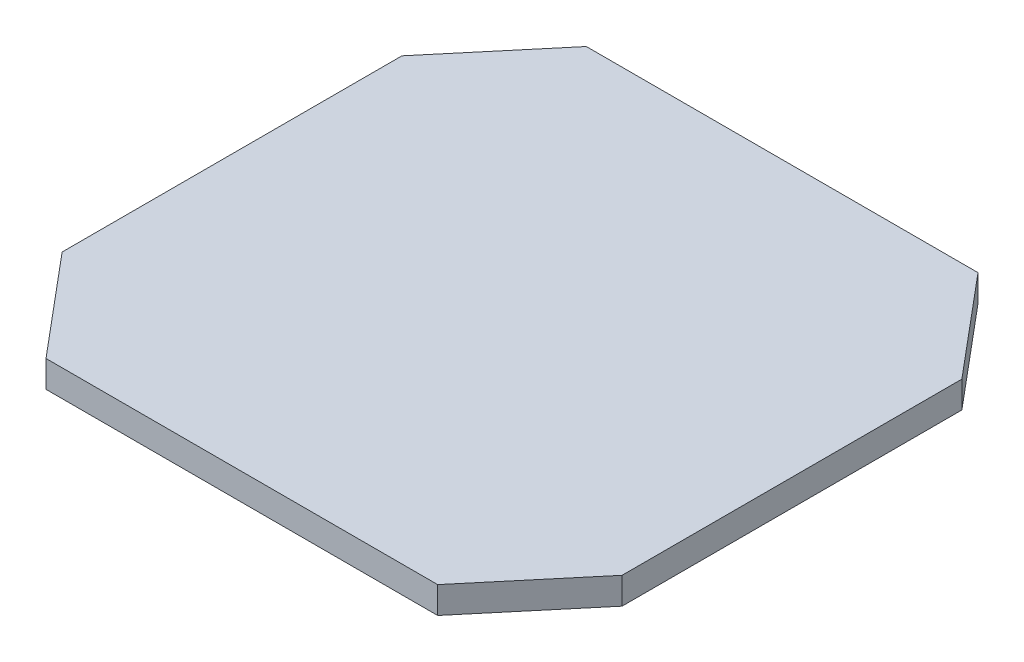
ISO-10303-21;
HEADER;
FILE_DESCRIPTION(('STEP AP214'),'2;1');
FILE_NAME('part.step','',(''),(''),'','','');
FILE_SCHEMA(('AUTOMOTIVE_DESIGN { 1 0 10303 214 1 1 1 1 }'));
ENDSEC;
DATA;
#1=APPLICATION_CONTEXT('core data for automotive mechanical design processes');
#2=APPLICATION_PROTOCOL_DEFINITION('international standard','automotive_design',2000,#1);
#3=PRODUCT_CONTEXT('',#1,'mechanical');
#4=PRODUCT('Part','Part','',(#3));
#5=PRODUCT_RELATED_PRODUCT_CATEGORY('part','',(#4));
#6=PRODUCT_DEFINITION_FORMATION('','',#4);
#7=PRODUCT_DEFINITION_CONTEXT('part definition',#1,'design');
#8=PRODUCT_DEFINITION('design','',#6,#7);
#9=PRODUCT_DEFINITION_SHAPE('','',#8);
#10=(LENGTH_UNIT() NAMED_UNIT(*) SI_UNIT(.MILLI.,.METRE.));
#11=(NAMED_UNIT(*) PLANE_ANGLE_UNIT() SI_UNIT($,.RADIAN.));
#12=(NAMED_UNIT(*) SI_UNIT($,.STERADIAN.) SOLID_ANGLE_UNIT());
#13=UNCERTAINTY_MEASURE_WITH_UNIT(LENGTH_MEASURE(1.E-05),#10,'distance_accuracy_value','');
#14=(GEOMETRIC_REPRESENTATION_CONTEXT(3) GLOBAL_UNCERTAINTY_ASSIGNED_CONTEXT((#13)) GLOBAL_UNIT_ASSIGNED_CONTEXT((#10,
#11,#12)) REPRESENTATION_CONTEXT('',''));
#15=CARTESIAN_POINT('',(0.,0.,0.));
#16=DIRECTION('',(0.,0.,1.));
#17=DIRECTION('',(1.,0.,0.));
#18=AXIS2_PLACEMENT_3D('',#15,#16,#17);
#19=CARTESIAN_POINT('',(-15.7,-1.5,9.52683869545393));
#20=DIRECTION('',(0.766044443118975,0.,-0.642787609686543));
#21=DIRECTION('',(-0.642787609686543,0.,-0.766044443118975));
#22=AXIS2_PLACEMENT_3D('',#19,#20,#21);
#23=PLANE('',#22);
#24=DIRECTION('',(-0.642787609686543,0.,-0.766044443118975));
#25=VECTOR('',#24,1.);
#26=CARTESIAN_POINT('',(-15.7,0.,9.52683869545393));
#27=LINE('',#26,#25);
#28=CARTESIAN_POINT('',(-10.9816252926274,0.,15.1499787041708));
#29=VERTEX_POINT('',#28);
#30=CARTESIAN_POINT('',(-15.7,0.,9.52683869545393));
#31=VERTEX_POINT('',#30);
#32=EDGE_CURVE('E139',#29,#31,#27,.T.);
#33=ORIENTED_EDGE('',*,*,#32,.T.);
#34=DIRECTION('',(0.,1.,0.));
#35=VECTOR('',#34,1.);
#36=CARTESIAN_POINT('',(-15.7,-1.5,9.52683869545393));
#37=LINE('',#36,#35);
#38=CARTESIAN_POINT('',(-15.7,-1.5,9.52683869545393));
#39=VERTEX_POINT('',#38);
#40=EDGE_CURVE('E12',#39,#31,#37,.T.);
#41=ORIENTED_EDGE('',*,*,#40,.F.);
#42=DIRECTION('',(-0.642787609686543,0.,-0.766044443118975));
#43=VECTOR('',#42,1.);
#44=CARTESIAN_POINT('',(-15.7,-1.5,9.52683869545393));
#45=LINE('',#44,#43);
#46=CARTESIAN_POINT('',(-10.9816252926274,-1.5,15.1499787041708));
#47=VERTEX_POINT('',#46);
#48=EDGE_CURVE('E153',#47,#39,#45,.T.);
#49=ORIENTED_EDGE('',*,*,#48,.F.);
#50=DIRECTION('',(0.,1.,0.));
#51=VECTOR('',#50,1.);
#52=CARTESIAN_POINT('',(-10.9816252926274,-1.5,15.1499787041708));
#53=LINE('',#52,#51);
#54=EDGE_CURVE('E135',#47,#29,#53,.T.);
#55=ORIENTED_EDGE('',*,*,#54,.T.);
#56=EDGE_LOOP('',(#33,#41,#49,#55));
#57=FACE_BOUND('',#56,.T.);
#58=ADVANCED_FACE('F43',(#57),#23,.F.);
#59=CARTESIAN_POINT('',(-15.7,-1.5,-9.52683869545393));
#60=DIRECTION('',(1.,0.,0.));
#61=DIRECTION('',(0.,0.,-1.));
#62=AXIS2_PLACEMENT_3D('',#59,#60,#61);
#63=PLANE('',#62);
#64=DIRECTION('',(0.,0.,-1.));
#65=VECTOR('',#64,1.);
#66=CARTESIAN_POINT('',(-15.7,0.,-9.52683869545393));
#67=LINE('',#66,#65);
#68=CARTESIAN_POINT('',(-15.7,0.,-9.52683869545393));
#69=VERTEX_POINT('',#68);
#70=EDGE_CURVE('E142',#31,#69,#67,.T.);
#71=ORIENTED_EDGE('',*,*,#70,.T.);
#72=DIRECTION('',(0.,1.,0.));
#73=VECTOR('',#72,1.);
#74=CARTESIAN_POINT('',(-15.7,-1.5,-9.52683869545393));
#75=LINE('',#74,#73);
#76=CARTESIAN_POINT('',(-15.7,-1.5,-9.52683869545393));
#77=VERTEX_POINT('',#76);
#78=EDGE_CURVE('E51',#77,#69,#75,.T.);
#79=ORIENTED_EDGE('',*,*,#78,.F.);
#80=DIRECTION('',(0.,0.,-1.));
#81=VECTOR('',#80,1.);
#82=CARTESIAN_POINT('',(-15.7,-1.5,-9.52683869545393));
#83=LINE('',#82,#81);
#84=EDGE_CURVE('E102',#39,#77,#83,.T.);
#85=ORIENTED_EDGE('',*,*,#84,.F.);
#86=ORIENTED_EDGE('',*,*,#40,.T.);
#87=EDGE_LOOP('',(#71,#79,#85,#86));
#88=FACE_BOUND('',#87,.T.);
#89=ADVANCED_FACE('F188',(#88),#63,.F.);
#90=CARTESIAN_POINT('',(-15.7,-1.5,-9.52683869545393));
#91=DIRECTION('',(0.766044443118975,0.,0.642787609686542));
#92=DIRECTION('',(0.642787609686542,0.,-0.766044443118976));
#93=AXIS2_PLACEMENT_3D('',#90,#91,#92);
#94=PLANE('',#93);
#95=DIRECTION('',(0.642787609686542,0.,-0.766044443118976));
#96=VECTOR('',#95,1.);
#97=CARTESIAN_POINT('',(-15.7,0.,-9.52683869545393));
#98=LINE('',#97,#96);
#99=CARTESIAN_POINT('',(-10.9816252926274,0.,-15.1499787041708));
#100=VERTEX_POINT('',#99);
#101=EDGE_CURVE('E144',#69,#100,#98,.T.);
#102=ORIENTED_EDGE('',*,*,#101,.T.);
#103=DIRECTION('',(0.,1.,0.));
#104=VECTOR('',#103,1.);
#105=CARTESIAN_POINT('',(-10.9816252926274,-1.5,-15.1499787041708));
#106=LINE('',#105,#104);
#107=CARTESIAN_POINT('',(-10.9816252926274,-1.5,-15.1499787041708));
#108=VERTEX_POINT('',#107);
#109=EDGE_CURVE('E160',#108,#100,#106,.T.);
#110=ORIENTED_EDGE('',*,*,#109,.F.);
#111=DIRECTION('',(0.642787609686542,0.,-0.766044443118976));
#112=VECTOR('',#111,1.);
#113=CARTESIAN_POINT('',(-15.7,-1.5,-9.52683869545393));
#114=LINE('',#113,#112);
#115=EDGE_CURVE('E168',#77,#108,#114,.T.);
#116=ORIENTED_EDGE('',*,*,#115,.F.);
#117=ORIENTED_EDGE('',*,*,#78,.T.);
#118=EDGE_LOOP('',(#102,#110,#116,#117));
#119=FACE_BOUND('',#118,.T.);
#120=ADVANCED_FACE('F166',(#119),#94,.F.);
#121=CARTESIAN_POINT('',(10.9816252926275,-1.5,-15.1499787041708));
#122=DIRECTION('',(0.,0.,1.));
#123=DIRECTION('',(1.,0.,0.));
#124=AXIS2_PLACEMENT_3D('',#121,#122,#123);
#125=PLANE('',#124);
#126=DIRECTION('',(1.,0.,0.));
#127=VECTOR('',#126,1.);
#128=CARTESIAN_POINT('',(10.9816252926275,0.,-15.1499787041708));
#129=LINE('',#128,#127);
#130=CARTESIAN_POINT('',(10.9816252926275,0.,-15.1499787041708));
#131=VERTEX_POINT('',#130);
#132=EDGE_CURVE('E146',#100,#131,#129,.T.);
#133=ORIENTED_EDGE('',*,*,#132,.T.);
#134=DIRECTION('',(0.,1.,0.));
#135=VECTOR('',#134,1.);
#136=CARTESIAN_POINT('',(10.9816252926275,-1.5,-15.1499787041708));
#137=LINE('',#136,#135);
#138=CARTESIAN_POINT('',(10.9816252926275,-1.5,-15.1499787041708));
#139=VERTEX_POINT('',#138);
#140=EDGE_CURVE('E157',#139,#131,#137,.T.);
#141=ORIENTED_EDGE('',*,*,#140,.F.);
#142=DIRECTION('',(1.,0.,0.));
#143=VECTOR('',#142,1.);
#144=CARTESIAN_POINT('',(10.9816252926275,-1.5,-15.1499787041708));
#145=LINE('',#144,#143);
#146=EDGE_CURVE('E180',#108,#139,#145,.T.);
#147=ORIENTED_EDGE('',*,*,#146,.F.);
#148=ORIENTED_EDGE('',*,*,#109,.T.);
#149=EDGE_LOOP('',(#133,#141,#147,#148));
#150=FACE_BOUND('',#149,.T.);
#151=ADVANCED_FACE('F176',(#150),#125,.F.);
#152=CARTESIAN_POINT('',(10.9816252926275,-1.5,-15.1499787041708));
#153=DIRECTION('',(-0.76604444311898,0.,0.642787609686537));
#154=DIRECTION('',(0.642787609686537,0.,0.76604444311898));
#155=AXIS2_PLACEMENT_3D('',#152,#153,#154);
#156=PLANE('',#155);
#157=DIRECTION('',(0.642787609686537,0.,0.76604444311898));
#158=VECTOR('',#157,1.);
#159=CARTESIAN_POINT('',(10.9816252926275,0.,-15.1499787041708));
#160=LINE('',#159,#158);
#161=CARTESIAN_POINT('',(15.7,0.,-9.52683869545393));
#162=VERTEX_POINT('',#161);
#163=EDGE_CURVE('E148',#131,#162,#160,.T.);
#164=ORIENTED_EDGE('',*,*,#163,.T.);
#165=DIRECTION('',(0.,1.,0.));
#166=VECTOR('',#165,1.);
#167=CARTESIAN_POINT('',(15.7,-1.5,-9.52683869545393));
#168=LINE('',#167,#166);
#169=CARTESIAN_POINT('',(15.7,-1.5,-9.52683869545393));
#170=VERTEX_POINT('',#169);
#171=EDGE_CURVE('E130',#170,#162,#168,.T.);
#172=ORIENTED_EDGE('',*,*,#171,.F.);
#173=DIRECTION('',(0.642787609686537,0.,0.76604444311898));
#174=VECTOR('',#173,1.);
#175=CARTESIAN_POINT('',(10.9816252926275,-1.5,-15.1499787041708));
#176=LINE('',#175,#174);
#177=EDGE_CURVE('E121',#139,#170,#176,.T.);
#178=ORIENTED_EDGE('',*,*,#177,.F.);
#179=ORIENTED_EDGE('',*,*,#140,.T.);
#180=EDGE_LOOP('',(#164,#172,#178,#179));
#181=FACE_BOUND('',#180,.T.);
#182=ADVANCED_FACE('F179',(#181),#156,.F.);
#183=CARTESIAN_POINT('',(15.7,-1.5,9.52683869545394));
#184=DIRECTION('',(-1.,0.,0.));
#185=DIRECTION('',(0.,0.,1.));
#186=AXIS2_PLACEMENT_3D('',#183,#184,#185);
#187=PLANE('',#186);
#188=DIRECTION('',(0.,0.,1.));
#189=VECTOR('',#188,1.);
#190=CARTESIAN_POINT('',(15.7,0.,9.52683869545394));
#191=LINE('',#190,#189);
#192=CARTESIAN_POINT('',(15.7,0.,9.52683869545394));
#193=VERTEX_POINT('',#192);
#194=EDGE_CURVE('E129',#162,#193,#191,.T.);
#195=ORIENTED_EDGE('',*,*,#194,.T.);
#196=DIRECTION('',(0.,1.,0.));
#197=VECTOR('',#196,1.);
#198=CARTESIAN_POINT('',(15.7,-1.5,9.52683869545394));
#199=LINE('',#198,#197);
#200=CARTESIAN_POINT('',(15.7,-1.5,9.52683869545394));
#201=VERTEX_POINT('',#200);
#202=EDGE_CURVE('E126',#201,#193,#199,.T.);
#203=ORIENTED_EDGE('',*,*,#202,.F.);
#204=DIRECTION('',(0.,0.,1.));
#205=VECTOR('',#204,1.);
#206=CARTESIAN_POINT('',(15.7,-1.5,9.52683869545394));
#207=LINE('',#206,#205);
#208=EDGE_CURVE('E115',#170,#201,#207,.T.);
#209=ORIENTED_EDGE('',*,*,#208,.F.);
#210=ORIENTED_EDGE('',*,*,#171,.T.);
#211=EDGE_LOOP('',(#195,#203,#209,#210));
#212=FACE_BOUND('',#211,.T.);
#213=ADVANCED_FACE('F127',(#212),#187,.F.);
#214=CARTESIAN_POINT('',(15.7,-1.5,9.52683869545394));
#215=DIRECTION('',(-0.76604444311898,0.,-0.642787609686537));
#216=DIRECTION('',(-0.642787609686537,0.,0.76604444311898));
#217=AXIS2_PLACEMENT_3D('',#214,#215,#216);
#218=PLANE('',#217);
#219=DIRECTION('',(-0.642787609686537,0.,0.76604444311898));
#220=VECTOR('',#219,1.);
#221=CARTESIAN_POINT('',(15.7,0.,9.52683869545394));
#222=LINE('',#221,#220);
#223=CARTESIAN_POINT('',(10.9816252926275,0.,15.1499787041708));
#224=VERTEX_POINT('',#223);
#225=EDGE_CURVE('E88',#193,#224,#222,.T.);
#226=ORIENTED_EDGE('',*,*,#225,.T.);
#227=DIRECTION('',(0.,1.,0.));
#228=VECTOR('',#227,1.);
#229=CARTESIAN_POINT('',(10.9816252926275,-1.5,15.1499787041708));
#230=LINE('',#229,#228);
#231=CARTESIAN_POINT('',(10.9816252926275,-1.5,15.1499787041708));
#232=VERTEX_POINT('',#231);
#233=EDGE_CURVE('E131',#232,#224,#230,.T.);
#234=ORIENTED_EDGE('',*,*,#233,.F.);
#235=DIRECTION('',(-0.642787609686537,0.,0.76604444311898));
#236=VECTOR('',#235,1.);
#237=CARTESIAN_POINT('',(15.7,-1.5,9.52683869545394));
#238=LINE('',#237,#236);
#239=EDGE_CURVE('E119',#201,#232,#238,.T.);
#240=ORIENTED_EDGE('',*,*,#239,.F.);
#241=ORIENTED_EDGE('',*,*,#202,.T.);
#242=EDGE_LOOP('',(#226,#234,#240,#241));
#243=FACE_BOUND('',#242,.T.);
#244=ADVANCED_FACE('F133',(#243),#218,.F.);
#245=CARTESIAN_POINT('',(-10.9816252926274,-1.5,15.1499787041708));
#246=DIRECTION('',(0.,0.,-1.));
#247=DIRECTION('',(-1.,0.,0.));
#248=AXIS2_PLACEMENT_3D('',#245,#246,#247);
#249=PLANE('',#248);
#250=DIRECTION('',(-1.,0.,0.));
#251=VECTOR('',#250,1.);
#252=CARTESIAN_POINT('',(-10.9816252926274,0.,15.1499787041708));
#253=LINE('',#252,#251);
#254=EDGE_CURVE('E94',#224,#29,#253,.T.);
#255=ORIENTED_EDGE('',*,*,#254,.T.);
#256=ORIENTED_EDGE('',*,*,#54,.F.);
#257=DIRECTION('',(-1.,0.,0.));
#258=VECTOR('',#257,1.);
#259=CARTESIAN_POINT('',(-10.9816252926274,-1.5,15.1499787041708));
#260=LINE('',#259,#258);
#261=EDGE_CURVE('E59',#232,#47,#260,.T.);
#262=ORIENTED_EDGE('',*,*,#261,.F.);
#263=ORIENTED_EDGE('',*,*,#233,.T.);
#264=EDGE_LOOP('',(#255,#256,#262,#263));
#265=FACE_BOUND('',#264,.T.);
#266=ADVANCED_FACE('F204',(#265),#249,.F.);
#267=CARTESIAN_POINT('',(0.,-1.5,0.));
#268=DIRECTION('',(0.,-1.,0.));
#269=DIRECTION('',(0.,0.,-1.));
#270=AXIS2_PLACEMENT_3D('',#267,#268,#269);
#271=PLANE('',#270);
#272=ORIENTED_EDGE('',*,*,#48,.T.);
#273=ORIENTED_EDGE('',*,*,#84,.T.);
#274=ORIENTED_EDGE('',*,*,#115,.T.);
#275=ORIENTED_EDGE('',*,*,#146,.T.);
#276=ORIENTED_EDGE('',*,*,#177,.T.);
#277=ORIENTED_EDGE('',*,*,#208,.T.);
#278=ORIENTED_EDGE('',*,*,#239,.T.);
#279=ORIENTED_EDGE('',*,*,#261,.T.);
#280=EDGE_LOOP('',(#272,#273,#274,#275,#276,#277,#278,#279));
#281=FACE_BOUND('',#280,.T.);
#282=ADVANCED_FACE('F117',(#281),#271,.T.);
#283=CARTESIAN_POINT('',(0.,0.,0.));
#284=DIRECTION('',(0.,-1.,0.));
#285=DIRECTION('',(0.,0.,-1.));
#286=AXIS2_PLACEMENT_3D('',#283,#284,#285);
#287=PLANE('',#286);
#288=ORIENTED_EDGE('',*,*,#32,.F.);
#289=ORIENTED_EDGE('',*,*,#254,.F.);
#290=ORIENTED_EDGE('',*,*,#225,.F.);
#291=ORIENTED_EDGE('',*,*,#194,.F.);
#292=ORIENTED_EDGE('',*,*,#163,.F.);
#293=ORIENTED_EDGE('',*,*,#132,.F.);
#294=ORIENTED_EDGE('',*,*,#101,.F.);
#295=ORIENTED_EDGE('',*,*,#70,.F.);
#296=EDGE_LOOP('',(#288,#289,#290,#291,#292,#293,#294,#295));
#297=FACE_BOUND('',#296,.T.);
#298=ADVANCED_FACE('F172',(#297),#287,.F.);
#299=CLOSED_SHELL('',(#58,#89,#120,#151,#182,#213,#244,#266,#282,#298));
#300=MANIFOLD_SOLID_BREP('B2',#299);
#301=ADVANCED_BREP_SHAPE_REPRESENTATION('',(#18,#300),#14);
#302=SHAPE_DEFINITION_REPRESENTATION(#9,#301);
ENDSEC;
END-ISO-10303-21;
